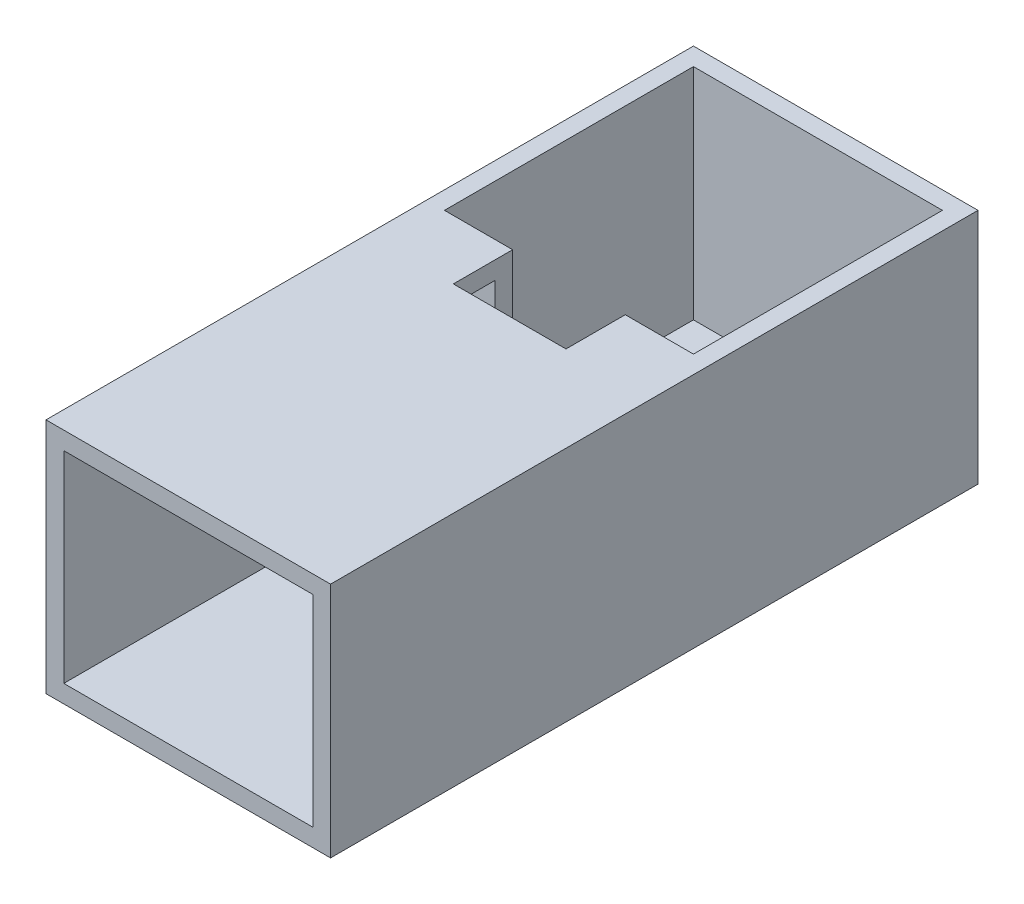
ISO-10303-21;
HEADER;
FILE_DESCRIPTION(('STEP AP214'),'2;1');
FILE_NAME('part.step','',(''),(''),'','','');
FILE_SCHEMA(('AUTOMOTIVE_DESIGN { 1 0 10303 214 1 1 1 1 }'));
ENDSEC;
DATA;
#1=APPLICATION_CONTEXT('core data for automotive mechanical design processes');
#2=APPLICATION_PROTOCOL_DEFINITION('international standard','automotive_design',2000,#1);
#3=PRODUCT_CONTEXT('',#1,'mechanical');
#4=PRODUCT('Part','Part','',(#3));
#5=PRODUCT_RELATED_PRODUCT_CATEGORY('part','',(#4));
#6=PRODUCT_DEFINITION_FORMATION('','',#4);
#7=PRODUCT_DEFINITION_CONTEXT('part definition',#1,'design');
#8=PRODUCT_DEFINITION('design','',#6,#7);
#9=PRODUCT_DEFINITION_SHAPE('','',#8);
#10=(LENGTH_UNIT() NAMED_UNIT(*) SI_UNIT(.MILLI.,.METRE.));
#11=(NAMED_UNIT(*) PLANE_ANGLE_UNIT() SI_UNIT($,.RADIAN.));
#12=(NAMED_UNIT(*) SI_UNIT($,.STERADIAN.) SOLID_ANGLE_UNIT());
#13=UNCERTAINTY_MEASURE_WITH_UNIT(LENGTH_MEASURE(1.E-05),#10,'distance_accuracy_value','');
#14=(GEOMETRIC_REPRESENTATION_CONTEXT(3) GLOBAL_UNCERTAINTY_ASSIGNED_CONTEXT((#13)) GLOBAL_UNIT_ASSIGNED_CONTEXT((#10,
#11,#12)) REPRESENTATION_CONTEXT('',''));
#15=CARTESIAN_POINT('',(0.,0.,0.));
#16=DIRECTION('',(0.,0.,1.));
#17=DIRECTION('',(1.,0.,0.));
#18=AXIS2_PLACEMENT_3D('',#15,#16,#17);
#19=CARTESIAN_POINT('',(29.5,40.,0.));
#20=DIRECTION('',(0.,0.,-1.));
#21=DIRECTION('',(-1.,0.,0.));
#22=AXIS2_PLACEMENT_3D('',#19,#20,#21);
#23=PLANE('',#22);
#24=DIRECTION('',(0.,1.,0.));
#25=VECTOR('',#24,1.);
#26=CARTESIAN_POINT('',(30.,-18.4709105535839,0.));
#27=LINE('',#26,#25);
#28=CARTESIAN_POINT('',(30.,3.,0.));
#29=VERTEX_POINT('',#28);
#30=CARTESIAN_POINT('',(30.,40.,0.));
#31=VERTEX_POINT('',#30);
#32=EDGE_CURVE('E172',#29,#31,#27,.T.);
#33=ORIENTED_EDGE('',*,*,#32,.T.);
#34=DIRECTION('',(1.,0.,0.));
#35=VECTOR('',#34,1.);
#36=CARTESIAN_POINT('',(-0.5,40.,0.));
#37=LINE('',#36,#35);
#38=CARTESIAN_POINT('',(41.5,40.,0.));
#39=VERTEX_POINT('',#38);
#40=EDGE_CURVE('E184',#31,#39,#37,.T.);
#41=ORIENTED_EDGE('',*,*,#40,.T.);
#42=DIRECTION('',(0.,-1.,0.));
#43=VECTOR('',#42,1.);
#44=CARTESIAN_POINT('',(41.5,40.,0.));
#45=LINE('',#44,#43);
#46=CARTESIAN_POINT('',(41.5,3.,0.));
#47=VERTEX_POINT('',#46);
#48=EDGE_CURVE('E211',#39,#47,#45,.T.);
#49=ORIENTED_EDGE('',*,*,#48,.T.);
#50=DIRECTION('',(1.,0.,0.));
#51=VECTOR('',#50,1.);
#52=CARTESIAN_POINT('',(-0.5,3.,0.));
#53=LINE('',#52,#51);
#54=EDGE_CURVE('E186',#29,#47,#53,.T.);
#55=ORIENTED_EDGE('',*,*,#54,.F.);
#56=EDGE_LOOP('',(#33,#41,#49,#55));
#57=FACE_BOUND('',#56,.T.);
#58=ADVANCED_FACE('F43',(#57),#23,.T.);
#59=CARTESIAN_POINT('',(29.5,40.,3.));
#60=DIRECTION('',(0.,0.,-1.));
#61=DIRECTION('',(-1.,0.,0.));
#62=AXIS2_PLACEMENT_3D('',#59,#60,#61);
#63=PLANE('',#62);
#64=DIRECTION('',(-1.,0.,0.));
#65=VECTOR('',#64,1.);
#66=CARTESIAN_POINT('',(-0.5,37.,3.));
#67=LINE('',#66,#65);
#68=CARTESIAN_POINT('',(41.5,37.,3.));
#69=VERTEX_POINT('',#68);
#70=CARTESIAN_POINT('',(30.,37.,3.));
#71=VERTEX_POINT('',#70);
#72=EDGE_CURVE('E262',#69,#71,#67,.T.);
#73=ORIENTED_EDGE('',*,*,#72,.T.);
#74=DIRECTION('',(0.,-1.,0.));
#75=VECTOR('',#74,1.);
#76=CARTESIAN_POINT('',(30.,40.,3.));
#77=LINE('',#76,#75);
#78=CARTESIAN_POINT('',(30.,3.,3.));
#79=VERTEX_POINT('',#78);
#80=EDGE_CURVE('E11',#71,#79,#77,.T.);
#81=ORIENTED_EDGE('',*,*,#80,.T.);
#82=DIRECTION('',(1.,0.,0.));
#83=VECTOR('',#82,1.);
#84=CARTESIAN_POINT('',(-0.5,3.,3.));
#85=LINE('',#84,#83);
#86=CARTESIAN_POINT('',(41.5,3.,3.));
#87=VERTEX_POINT('',#86);
#88=EDGE_CURVE('E274',#79,#87,#85,.T.);
#89=ORIENTED_EDGE('',*,*,#88,.T.);
#90=DIRECTION('',(0.,1.,0.));
#91=VECTOR('',#90,1.);
#92=CARTESIAN_POINT('',(41.5,37.,3.));
#93=LINE('',#92,#91);
#94=EDGE_CURVE('E276',#87,#69,#93,.T.);
#95=ORIENTED_EDGE('',*,*,#94,.T.);
#96=EDGE_LOOP('',(#73,#81,#89,#95));
#97=FACE_BOUND('',#96,.T.);
#98=ADVANCED_FACE('F327',(#97),#63,.F.);
#99=CARTESIAN_POINT('',(0.,3.,0.));
#100=DIRECTION('',(0.,-1.,0.));
#101=DIRECTION('',(0.,0.,-1.));
#102=AXIS2_PLACEMENT_3D('',#99,#100,#101);
#103=PLANE('',#102);
#104=DIRECTION('',(-1.,0.,0.));
#105=VECTOR('',#104,1.);
#106=CARTESIAN_POINT('',(-0.5,3.,-42.));
#107=LINE('',#106,#105);
#108=CARTESIAN_POINT('',(41.5,3.,-42.));
#109=VERTEX_POINT('',#108);
#110=CARTESIAN_POINT('',(-0.5,3.,-42.));
#111=VERTEX_POINT('',#110);
#112=EDGE_CURVE('E234',#109,#111,#107,.T.);
#113=ORIENTED_EDGE('',*,*,#112,.T.);
#114=DIRECTION('',(0.,0.,1.));
#115=VECTOR('',#114,1.);
#116=CARTESIAN_POINT('',(-0.5,3.,-37.5028008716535));
#117=LINE('',#116,#115);
#118=CARTESIAN_POINT('',(-0.5,3.,0.));
#119=VERTEX_POINT('',#118);
#120=EDGE_CURVE('E237',#111,#119,#117,.T.);
#121=ORIENTED_EDGE('',*,*,#120,.T.);
#122=CARTESIAN_POINT('',(11.,3.,0.));
#123=VERTEX_POINT('',#122);
#124=EDGE_CURVE('E240',#119,#123,#53,.T.);
#125=ORIENTED_EDGE('',*,*,#124,.T.);
#126=DIRECTION('',(0.,0.,1.));
#127=VECTOR('',#126,1.);
#128=CARTESIAN_POINT('',(11.,3.,0.));
#129=LINE('',#128,#127);
#130=CARTESIAN_POINT('',(11.,3.,3.));
#131=VERTEX_POINT('',#130);
#132=EDGE_CURVE('E354',#123,#131,#129,.T.);
#133=ORIENTED_EDGE('',*,*,#132,.T.);
#134=CARTESIAN_POINT('',(-0.5,3.,3.));
#135=VERTEX_POINT('',#134);
#136=EDGE_CURVE('E253',#135,#131,#85,.T.);
#137=ORIENTED_EDGE('',*,*,#136,.F.);
#138=DIRECTION('',(0.,0.,-1.));
#139=VECTOR('',#138,1.);
#140=CARTESIAN_POINT('',(-0.5,3.,64.21));
#141=LINE('',#140,#139);
#142=CARTESIAN_POINT('',(-0.5,3.,64.21));
#143=VERTEX_POINT('',#142);
#144=EDGE_CURVE('E285',#143,#135,#141,.T.);
#145=ORIENTED_EDGE('',*,*,#144,.F.);
#146=DIRECTION('',(1.,0.,0.));
#147=VECTOR('',#146,1.);
#148=CARTESIAN_POINT('',(-0.5,3.,64.21));
#149=LINE('',#148,#147);
#150=CARTESIAN_POINT('',(41.5,3.,64.21));
#151=VERTEX_POINT('',#150);
#152=EDGE_CURVE('E373',#143,#151,#149,.T.);
#153=ORIENTED_EDGE('',*,*,#152,.T.);
#154=DIRECTION('',(0.,0.,-1.));
#155=VECTOR('',#154,1.);
#156=CARTESIAN_POINT('',(41.5,3.,64.21));
#157=LINE('',#156,#155);
#158=EDGE_CURVE('E282',#151,#87,#157,.T.);
#159=ORIENTED_EDGE('',*,*,#158,.T.);
#160=ORIENTED_EDGE('',*,*,#88,.F.);
#161=DIRECTION('',(0.,0.,-1.));
#162=VECTOR('',#161,1.);
#163=CARTESIAN_POINT('',(30.,3.,0.));
#164=LINE('',#163,#162);
#165=EDGE_CURVE('E187',#79,#29,#164,.T.);
#166=ORIENTED_EDGE('',*,*,#165,.T.);
#167=ORIENTED_EDGE('',*,*,#54,.T.);
#168=DIRECTION('',(0.,0.,-1.));
#169=VECTOR('',#168,1.);
#170=CARTESIAN_POINT('',(41.5,3.,0.));
#171=LINE('',#170,#169);
#172=EDGE_CURVE('E243',#47,#109,#171,.T.);
#173=ORIENTED_EDGE('',*,*,#172,.T.);
#174=EDGE_LOOP('',(#113,#121,#125,#133,#137,#145,#153,#159,#160,#166,#167,#173));
#175=FACE_BOUND('',#174,.T.);
#176=ADVANCED_FACE('F334',(#175),#103,.F.);
#177=CARTESIAN_POINT('',(-0.5,40.,0.));
#178=DIRECTION('',(1.,0.,0.));
#179=DIRECTION('',(0.,0.,-1.));
#180=AXIS2_PLACEMENT_3D('',#177,#178,#179);
#181=PLANE('',#180);
#182=ORIENTED_EDGE('',*,*,#120,.F.);
#183=DIRECTION('',(0.,-1.,0.));
#184=VECTOR('',#183,1.);
#185=CARTESIAN_POINT('',(-0.5,40.,-42.));
#186=LINE('',#185,#184);
#187=CARTESIAN_POINT('',(-0.5,40.,-42.));
#188=VERTEX_POINT('',#187);
#189=EDGE_CURVE('E206',#188,#111,#186,.T.);
#190=ORIENTED_EDGE('',*,*,#189,.F.);
#191=DIRECTION('',(0.,0.,1.));
#192=VECTOR('',#191,1.);
#193=CARTESIAN_POINT('',(-0.5,40.,0.));
#194=LINE('',#193,#192);
#195=CARTESIAN_POINT('',(-0.5,40.,0.));
#196=VERTEX_POINT('',#195);
#197=EDGE_CURVE('E196',#188,#196,#194,.T.);
#198=ORIENTED_EDGE('',*,*,#197,.T.);
#199=DIRECTION('',(0.,-1.,0.));
#200=VECTOR('',#199,1.);
#201=CARTESIAN_POINT('',(-0.5,40.,0.));
#202=LINE('',#201,#200);
#203=EDGE_CURVE('E213',#196,#119,#202,.T.);
#204=ORIENTED_EDGE('',*,*,#203,.T.);
#205=EDGE_LOOP('',(#182,#190,#198,#204));
#206=FACE_BOUND('',#205,.T.);
#207=ADVANCED_FACE('F341',(#206),#181,.T.);
#208=DIRECTION('',(0.,1.,0.));
#209=VECTOR('',#208,1.);
#210=CARTESIAN_POINT('',(11.,-18.4709105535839,0.));
#211=LINE('',#210,#209);
#212=CARTESIAN_POINT('',(11.,40.,0.));
#213=VERTEX_POINT('',#212);
#214=EDGE_CURVE('E58',#123,#213,#211,.T.);
#215=ORIENTED_EDGE('',*,*,#214,.F.);
#216=ORIENTED_EDGE('',*,*,#124,.F.);
#217=ORIENTED_EDGE('',*,*,#203,.F.);
#218=EDGE_CURVE('E195',#196,#213,#37,.T.);
#219=ORIENTED_EDGE('',*,*,#218,.T.);
#220=EDGE_LOOP('',(#215,#216,#217,#219));
#221=FACE_BOUND('',#220,.T.);
#222=ADVANCED_FACE('F329',(#221),#23,.T.);
#223=CARTESIAN_POINT('',(41.5,40.,0.));
#224=DIRECTION('',(-1.,0.,0.));
#225=DIRECTION('',(0.,0.,1.));
#226=AXIS2_PLACEMENT_3D('',#223,#224,#225);
#227=PLANE('',#226);
#228=ORIENTED_EDGE('',*,*,#172,.F.);
#229=ORIENTED_EDGE('',*,*,#48,.F.);
#230=DIRECTION('',(0.,0.,-1.));
#231=VECTOR('',#230,1.);
#232=CARTESIAN_POINT('',(41.5,40.,0.));
#233=LINE('',#232,#231);
#234=CARTESIAN_POINT('',(41.5,40.,-42.));
#235=VERTEX_POINT('',#234);
#236=EDGE_CURVE('E194',#39,#235,#233,.T.);
#237=ORIENTED_EDGE('',*,*,#236,.T.);
#238=DIRECTION('',(0.,-1.,0.));
#239=VECTOR('',#238,1.);
#240=CARTESIAN_POINT('',(41.5,40.,-42.));
#241=LINE('',#240,#239);
#242=EDGE_CURVE('E208',#235,#109,#241,.T.);
#243=ORIENTED_EDGE('',*,*,#242,.T.);
#244=EDGE_LOOP('',(#228,#229,#237,#243));
#245=FACE_BOUND('',#244,.T.);
#246=ADVANCED_FACE('F340',(#245),#227,.T.);
#247=CARTESIAN_POINT('',(-0.5,40.,-42.));
#248=DIRECTION('',(0.,0.,1.));
#249=DIRECTION('',(1.,0.,0.));
#250=AXIS2_PLACEMENT_3D('',#247,#248,#249);
#251=PLANE('',#250);
#252=ORIENTED_EDGE('',*,*,#112,.F.);
#253=ORIENTED_EDGE('',*,*,#242,.F.);
#254=DIRECTION('',(-1.,0.,0.));
#255=VECTOR('',#254,1.);
#256=CARTESIAN_POINT('',(-0.5,40.,-42.));
#257=LINE('',#256,#255);
#258=EDGE_CURVE('E204',#235,#188,#257,.T.);
#259=ORIENTED_EDGE('',*,*,#258,.T.);
#260=ORIENTED_EDGE('',*,*,#189,.T.);
#261=EDGE_LOOP('',(#252,#253,#259,#260));
#262=FACE_BOUND('',#261,.T.);
#263=ADVANCED_FACE('F348',(#262),#251,.T.);
#264=CARTESIAN_POINT('',(0.,40.,0.));
#265=DIRECTION('',(0.,1.,0.));
#266=DIRECTION('',(0.,0.,1.));
#267=AXIS2_PLACEMENT_3D('',#264,#265,#266);
#268=PLANE('',#267);
#269=DIRECTION('',(0.,0.,-1.));
#270=VECTOR('',#269,1.);
#271=CARTESIAN_POINT('',(30.,40.,0.));
#272=LINE('',#271,#270);
#273=CARTESIAN_POINT('',(30.,40.,10.));
#274=VERTEX_POINT('',#273);
#275=EDGE_CURVE('E169',#274,#31,#272,.T.);
#276=ORIENTED_EDGE('',*,*,#275,.F.);
#277=DIRECTION('',(1.,0.,0.));
#278=VECTOR('',#277,1.);
#279=CARTESIAN_POINT('',(11.,40.,10.));
#280=LINE('',#279,#278);
#281=CARTESIAN_POINT('',(11.,40.,10.));
#282=VERTEX_POINT('',#281);
#283=EDGE_CURVE('E180',#282,#274,#280,.T.);
#284=ORIENTED_EDGE('',*,*,#283,.F.);
#285=DIRECTION('',(0.,0.,1.));
#286=VECTOR('',#285,1.);
#287=CARTESIAN_POINT('',(11.,40.,0.));
#288=LINE('',#287,#286);
#289=EDGE_CURVE('E360',#213,#282,#288,.T.);
#290=ORIENTED_EDGE('',*,*,#289,.F.);
#291=ORIENTED_EDGE('',*,*,#218,.F.);
#292=ORIENTED_EDGE('',*,*,#197,.F.);
#293=ORIENTED_EDGE('',*,*,#258,.F.);
#294=ORIENTED_EDGE('',*,*,#236,.F.);
#295=ORIENTED_EDGE('',*,*,#40,.F.);
#296=EDGE_LOOP('',(#276,#284,#290,#291,#292,#293,#294,#295));
#297=FACE_BOUND('',#296,.T.);
#298=DIRECTION('',(0.,0.,1.));
#299=VECTOR('',#298,1.);
#300=CARTESIAN_POINT('',(-3.5,40.,3.));
#301=LINE('',#300,#299);
#302=CARTESIAN_POINT('',(-3.5,40.,-45.));
#303=VERTEX_POINT('',#302);
#304=CARTESIAN_POINT('',(-3.5,40.,64.21));
#305=VERTEX_POINT('',#304);
#306=EDGE_CURVE('E222',#303,#305,#301,.T.);
#307=ORIENTED_EDGE('',*,*,#306,.T.);
#308=DIRECTION('',(-1.,0.,0.));
#309=VECTOR('',#308,1.);
#310=CARTESIAN_POINT('',(-3.5,40.,64.21));
#311=LINE('',#310,#309);
#312=CARTESIAN_POINT('',(44.5,40.,64.21));
#313=VERTEX_POINT('',#312);
#314=EDGE_CURVE('E199',#313,#305,#311,.T.);
#315=ORIENTED_EDGE('',*,*,#314,.F.);
#316=DIRECTION('',(0.,0.,-1.));
#317=VECTOR('',#316,1.);
#318=CARTESIAN_POINT('',(44.5,40.,3.));
#319=LINE('',#318,#317);
#320=CARTESIAN_POINT('',(44.5,40.,-45.));
#321=VERTEX_POINT('',#320);
#322=EDGE_CURVE('E217',#313,#321,#319,.T.);
#323=ORIENTED_EDGE('',*,*,#322,.T.);
#324=DIRECTION('',(-1.,0.,0.));
#325=VECTOR('',#324,1.);
#326=CARTESIAN_POINT('',(-3.5,40.,-45.));
#327=LINE('',#326,#325);
#328=EDGE_CURVE('E219',#321,#303,#327,.T.);
#329=ORIENTED_EDGE('',*,*,#328,.T.);
#330=EDGE_LOOP('',(#307,#315,#323,#329));
#331=FACE_BOUND('',#330,.T.);
#332=ADVANCED_FACE('F190',(#297,#331),#268,.T.);
#333=CARTESIAN_POINT('',(44.5,40.,3.));
#334=DIRECTION('',(-1.,0.,0.));
#335=DIRECTION('',(0.,0.,1.));
#336=AXIS2_PLACEMENT_3D('',#333,#334,#335);
#337=PLANE('',#336);
#338=DIRECTION('',(0.,0.,-1.));
#339=VECTOR('',#338,1.);
#340=CARTESIAN_POINT('',(44.5,0.,3.));
#341=LINE('',#340,#339);
#342=CARTESIAN_POINT('',(44.5,0.,64.21));
#343=VERTEX_POINT('',#342);
#344=CARTESIAN_POINT('',(44.5,0.,-45.));
#345=VERTEX_POINT('',#344);
#346=EDGE_CURVE('E216',#343,#345,#341,.T.);
#347=ORIENTED_EDGE('',*,*,#346,.T.);
#348=DIRECTION('',(0.,-1.,0.));
#349=VECTOR('',#348,1.);
#350=CARTESIAN_POINT('',(44.5,40.,-45.));
#351=LINE('',#350,#349);
#352=EDGE_CURVE('E231',#321,#345,#351,.T.);
#353=ORIENTED_EDGE('',*,*,#352,.F.);
#354=ORIENTED_EDGE('',*,*,#322,.F.);
#355=DIRECTION('',(0.,1.,0.));
#356=VECTOR('',#355,1.);
#357=CARTESIAN_POINT('',(44.5,40.,64.21));
#358=LINE('',#357,#356);
#359=EDGE_CURVE('E294',#343,#313,#358,.T.);
#360=ORIENTED_EDGE('',*,*,#359,.F.);
#361=EDGE_LOOP('',(#347,#353,#354,#360));
#362=FACE_BOUND('',#361,.T.);
#363=ADVANCED_FACE('F312',(#362),#337,.F.);
#364=CARTESIAN_POINT('',(-3.5,40.,-45.));
#365=DIRECTION('',(0.,0.,1.));
#366=DIRECTION('',(1.,0.,0.));
#367=AXIS2_PLACEMENT_3D('',#364,#365,#366);
#368=PLANE('',#367);
#369=DIRECTION('',(-1.,0.,0.));
#370=VECTOR('',#369,1.);
#371=CARTESIAN_POINT('',(-3.5,0.,-45.));
#372=LINE('',#371,#370);
#373=CARTESIAN_POINT('',(-3.5,0.,-45.));
#374=VERTEX_POINT('',#373);
#375=EDGE_CURVE('E226',#345,#374,#372,.T.);
#376=ORIENTED_EDGE('',*,*,#375,.T.);
#377=DIRECTION('',(0.,-1.,0.));
#378=VECTOR('',#377,1.);
#379=CARTESIAN_POINT('',(-3.5,40.,-45.));
#380=LINE('',#379,#378);
#381=EDGE_CURVE('E224',#303,#374,#380,.T.);
#382=ORIENTED_EDGE('',*,*,#381,.F.);
#383=ORIENTED_EDGE('',*,*,#328,.F.);
#384=ORIENTED_EDGE('',*,*,#352,.T.);
#385=EDGE_LOOP('',(#376,#382,#383,#384));
#386=FACE_BOUND('',#385,.T.);
#387=ADVANCED_FACE('F316',(#386),#368,.F.);
#388=CARTESIAN_POINT('',(-3.5,40.,3.));
#389=DIRECTION('',(1.,0.,0.));
#390=DIRECTION('',(0.,0.,-1.));
#391=AXIS2_PLACEMENT_3D('',#388,#389,#390);
#392=PLANE('',#391);
#393=DIRECTION('',(0.,0.,1.));
#394=VECTOR('',#393,1.);
#395=CARTESIAN_POINT('',(-3.5,0.,3.));
#396=LINE('',#395,#394);
#397=CARTESIAN_POINT('',(-3.5,0.,64.21));
#398=VERTEX_POINT('',#397);
#399=EDGE_CURVE('E220',#374,#398,#396,.T.);
#400=ORIENTED_EDGE('',*,*,#399,.T.);
#401=DIRECTION('',(0.,-1.,0.));
#402=VECTOR('',#401,1.);
#403=CARTESIAN_POINT('',(-3.5,40.,64.21));
#404=LINE('',#403,#402);
#405=EDGE_CURVE('E288',#305,#398,#404,.T.);
#406=ORIENTED_EDGE('',*,*,#405,.F.);
#407=ORIENTED_EDGE('',*,*,#306,.F.);
#408=ORIENTED_EDGE('',*,*,#381,.T.);
#409=EDGE_LOOP('',(#400,#406,#407,#408));
#410=FACE_BOUND('',#409,.T.);
#411=ADVANCED_FACE('F305',(#410),#392,.F.);
#412=CARTESIAN_POINT('',(0.,0.,0.));
#413=DIRECTION('',(0.,-1.,0.));
#414=DIRECTION('',(0.,0.,-1.));
#415=AXIS2_PLACEMENT_3D('',#412,#413,#414);
#416=PLANE('',#415);
#417=ORIENTED_EDGE('',*,*,#346,.F.);
#418=DIRECTION('',(1.,0.,0.));
#419=VECTOR('',#418,1.);
#420=CARTESIAN_POINT('',(-3.5,0.,64.21));
#421=LINE('',#420,#419);
#422=EDGE_CURVE('E291',#398,#343,#421,.T.);
#423=ORIENTED_EDGE('',*,*,#422,.F.);
#424=ORIENTED_EDGE('',*,*,#399,.F.);
#425=ORIENTED_EDGE('',*,*,#375,.F.);
#426=EDGE_LOOP('',(#417,#423,#424,#425));
#427=FACE_BOUND('',#426,.T.);
#428=ADVANCED_FACE('F45',(#427),#416,.T.);
#429=CARTESIAN_POINT('',(0.,0.,64.21));
#430=DIRECTION('',(0.,0.,1.));
#431=DIRECTION('',(1.,0.,0.));
#432=AXIS2_PLACEMENT_3D('',#429,#430,#431);
#433=PLANE('',#432);
#434=ORIENTED_EDGE('',*,*,#405,.T.);
#435=ORIENTED_EDGE('',*,*,#422,.T.);
#436=ORIENTED_EDGE('',*,*,#359,.T.);
#437=ORIENTED_EDGE('',*,*,#314,.T.);
#438=EDGE_LOOP('',(#434,#435,#436,#437));
#439=FACE_BOUND('',#438,.T.);
#440=DIRECTION('',(0.,-1.,0.));
#441=VECTOR('',#440,1.);
#442=CARTESIAN_POINT('',(-0.5,37.,64.21));
#443=LINE('',#442,#441);
#444=CARTESIAN_POINT('',(-0.5,37.,64.21));
#445=VERTEX_POINT('',#444);
#446=EDGE_CURVE('E372',#445,#143,#443,.T.);
#447=ORIENTED_EDGE('',*,*,#446,.F.);
#448=DIRECTION('',(-1.,0.,0.));
#449=VECTOR('',#448,1.);
#450=CARTESIAN_POINT('',(-0.5,37.,64.21));
#451=LINE('',#450,#449);
#452=CARTESIAN_POINT('',(41.5,37.,64.21));
#453=VERTEX_POINT('',#452);
#454=EDGE_CURVE('E279',#453,#445,#451,.T.);
#455=ORIENTED_EDGE('',*,*,#454,.F.);
#456=DIRECTION('',(0.,1.,0.));
#457=VECTOR('',#456,1.);
#458=CARTESIAN_POINT('',(41.5,37.,64.21));
#459=LINE('',#458,#457);
#460=EDGE_CURVE('E271',#151,#453,#459,.T.);
#461=ORIENTED_EDGE('',*,*,#460,.F.);
#462=ORIENTED_EDGE('',*,*,#152,.F.);
#463=EDGE_LOOP('',(#447,#455,#461,#462));
#464=FACE_BOUND('',#463,.T.);
#465=ADVANCED_FACE('F300',(#439,#464),#433,.T.);
#466=CARTESIAN_POINT('',(-0.5,37.,64.21));
#467=DIRECTION('',(0.,-1.,0.));
#468=DIRECTION('',(0.,0.,-1.));
#469=AXIS2_PLACEMENT_3D('',#466,#467,#468);
#470=PLANE('',#469);
#471=DIRECTION('',(0.,0.,1.));
#472=VECTOR('',#471,1.);
#473=CARTESIAN_POINT('',(30.,37.,64.21));
#474=LINE('',#473,#472);
#475=CARTESIAN_POINT('',(30.,37.,10.));
#476=VERTEX_POINT('',#475);
#477=EDGE_CURVE('E267',#71,#476,#474,.T.);
#478=ORIENTED_EDGE('',*,*,#477,.F.);
#479=ORIENTED_EDGE('',*,*,#72,.F.);
#480=DIRECTION('',(0.,0.,-1.));
#481=VECTOR('',#480,1.);
#482=CARTESIAN_POINT('',(41.5,37.,64.21));
#483=LINE('',#482,#481);
#484=EDGE_CURVE('E280',#453,#69,#483,.T.);
#485=ORIENTED_EDGE('',*,*,#484,.F.);
#486=ORIENTED_EDGE('',*,*,#454,.T.);
#487=DIRECTION('',(0.,0.,-1.));
#488=VECTOR('',#487,1.);
#489=CARTESIAN_POINT('',(-0.5,37.,64.21));
#490=LINE('',#489,#488);
#491=CARTESIAN_POINT('',(-0.5,37.,3.));
#492=VERTEX_POINT('',#491);
#493=EDGE_CURVE('E261',#445,#492,#490,.T.);
#494=ORIENTED_EDGE('',*,*,#493,.T.);
#495=CARTESIAN_POINT('',(11.,37.,3.));
#496=VERTEX_POINT('',#495);
#497=EDGE_CURVE('E250',#496,#492,#67,.T.);
#498=ORIENTED_EDGE('',*,*,#497,.F.);
#499=DIRECTION('',(0.,0.,-1.));
#500=VECTOR('',#499,1.);
#501=CARTESIAN_POINT('',(11.,37.,64.21));
#502=LINE('',#501,#500);
#503=CARTESIAN_POINT('',(11.,37.,10.));
#504=VERTEX_POINT('',#503);
#505=EDGE_CURVE('E65',#504,#496,#502,.T.);
#506=ORIENTED_EDGE('',*,*,#505,.F.);
#507=DIRECTION('',(-1.,0.,0.));
#508=VECTOR('',#507,1.);
#509=CARTESIAN_POINT('',(-0.500000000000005,37.,10.));
#510=LINE('',#509,#508);
#511=EDGE_CURVE('E263',#476,#504,#510,.T.);
#512=ORIENTED_EDGE('',*,*,#511,.F.);
#513=EDGE_LOOP('',(#478,#479,#485,#486,#494,#498,#506,#512));
#514=FACE_BOUND('',#513,.T.);
#515=ADVANCED_FACE('F258',(#514),#470,.T.);
#516=CARTESIAN_POINT('',(-0.5,37.,64.21));
#517=DIRECTION('',(1.,0.,0.));
#518=DIRECTION('',(0.,0.,-1.));
#519=AXIS2_PLACEMENT_3D('',#516,#517,#518);
#520=PLANE('',#519);
#521=DIRECTION('',(0.,-1.,0.));
#522=VECTOR('',#521,1.);
#523=CARTESIAN_POINT('',(-0.5,37.,3.));
#524=LINE('',#523,#522);
#525=EDGE_CURVE('E266',#492,#135,#524,.T.);
#526=ORIENTED_EDGE('',*,*,#525,.F.);
#527=ORIENTED_EDGE('',*,*,#493,.F.);
#528=ORIENTED_EDGE('',*,*,#446,.T.);
#529=ORIENTED_EDGE('',*,*,#144,.T.);
#530=EDGE_LOOP('',(#526,#527,#528,#529));
#531=FACE_BOUND('',#530,.T.);
#532=ADVANCED_FACE('F386',(#531),#520,.T.);
#533=CARTESIAN_POINT('',(41.5,37.,64.21));
#534=DIRECTION('',(-1.,0.,0.));
#535=DIRECTION('',(0.,0.,1.));
#536=AXIS2_PLACEMENT_3D('',#533,#534,#535);
#537=PLANE('',#536);
#538=ORIENTED_EDGE('',*,*,#94,.F.);
#539=ORIENTED_EDGE('',*,*,#158,.F.);
#540=ORIENTED_EDGE('',*,*,#460,.T.);
#541=ORIENTED_EDGE('',*,*,#484,.T.);
#542=EDGE_LOOP('',(#538,#539,#540,#541));
#543=FACE_BOUND('',#542,.T.);
#544=ADVANCED_FACE('F381',(#543),#537,.T.);
#545=ORIENTED_EDGE('',*,*,#136,.T.);
#546=DIRECTION('',(0.,1.,0.));
#547=VECTOR('',#546,1.);
#548=CARTESIAN_POINT('',(11.,40.,3.));
#549=LINE('',#548,#547);
#550=EDGE_CURVE('E51',#131,#496,#549,.T.);
#551=ORIENTED_EDGE('',*,*,#550,.T.);
#552=ORIENTED_EDGE('',*,*,#497,.T.);
#553=ORIENTED_EDGE('',*,*,#525,.T.);
#554=EDGE_LOOP('',(#545,#551,#552,#553));
#555=FACE_BOUND('',#554,.T.);
#556=ADVANCED_FACE('F248',(#555),#63,.F.);
#557=CARTESIAN_POINT('',(11.,-18.4709105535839,10.));
#558=DIRECTION('',(0.,0.,1.));
#559=DIRECTION('',(1.,0.,0.));
#560=AXIS2_PLACEMENT_3D('',#557,#558,#559);
#561=PLANE('',#560);
#562=ORIENTED_EDGE('',*,*,#511,.T.);
#563=DIRECTION('',(0.,1.,0.));
#564=VECTOR('',#563,1.);
#565=CARTESIAN_POINT('',(11.,-18.4709105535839,10.));
#566=LINE('',#565,#564);
#567=EDGE_CURVE('E365',#504,#282,#566,.T.);
#568=ORIENTED_EDGE('',*,*,#567,.T.);
#569=ORIENTED_EDGE('',*,*,#283,.T.);
#570=DIRECTION('',(0.,1.,0.));
#571=VECTOR('',#570,1.);
#572=CARTESIAN_POINT('',(30.,-18.4709105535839,10.));
#573=LINE('',#572,#571);
#574=EDGE_CURVE('E175',#476,#274,#573,.T.);
#575=ORIENTED_EDGE('',*,*,#574,.F.);
#576=EDGE_LOOP('',(#562,#568,#569,#575));
#577=FACE_BOUND('',#576,.T.);
#578=ADVANCED_FACE('F405',(#577),#561,.F.);
#579=CARTESIAN_POINT('',(30.,-18.4709105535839,0.));
#580=DIRECTION('',(1.,0.,0.));
#581=DIRECTION('',(0.,0.,-1.));
#582=AXIS2_PLACEMENT_3D('',#579,#580,#581);
#583=PLANE('',#582);
#584=ORIENTED_EDGE('',*,*,#477,.T.);
#585=ORIENTED_EDGE('',*,*,#574,.T.);
#586=ORIENTED_EDGE('',*,*,#275,.T.);
#587=ORIENTED_EDGE('',*,*,#32,.F.);
#588=ORIENTED_EDGE('',*,*,#165,.F.);
#589=ORIENTED_EDGE('',*,*,#80,.F.);
#590=EDGE_LOOP('',(#584,#585,#586,#587,#588,#589));
#591=FACE_BOUND('',#590,.T.);
#592=ADVANCED_FACE('F171',(#591),#583,.F.);
#593=CARTESIAN_POINT('',(11.,-18.4709105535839,0.));
#594=DIRECTION('',(-1.,0.,0.));
#595=DIRECTION('',(0.,0.,1.));
#596=AXIS2_PLACEMENT_3D('',#593,#594,#595);
#597=PLANE('',#596);
#598=ORIENTED_EDGE('',*,*,#505,.T.);
#599=ORIENTED_EDGE('',*,*,#550,.F.);
#600=ORIENTED_EDGE('',*,*,#132,.F.);
#601=ORIENTED_EDGE('',*,*,#214,.T.);
#602=ORIENTED_EDGE('',*,*,#289,.T.);
#603=ORIENTED_EDGE('',*,*,#567,.F.);
#604=EDGE_LOOP('',(#598,#599,#600,#601,#602,#603));
#605=FACE_BOUND('',#604,.T.);
#606=ADVANCED_FACE('F406',(#605),#597,.F.);
#607=CLOSED_SHELL('',(#58,#98,#176,#207,#222,#246,#263,#332,#363,#387,#411,#428,#465,#515,#532,
#544,#556,#578,#592,#606));
#608=MANIFOLD_SOLID_BREP('B2',#607);
#609=ADVANCED_BREP_SHAPE_REPRESENTATION('',(#18,#608),#14);
#610=SHAPE_DEFINITION_REPRESENTATION(#9,#609);
ENDSEC;
END-ISO-10303-21;
